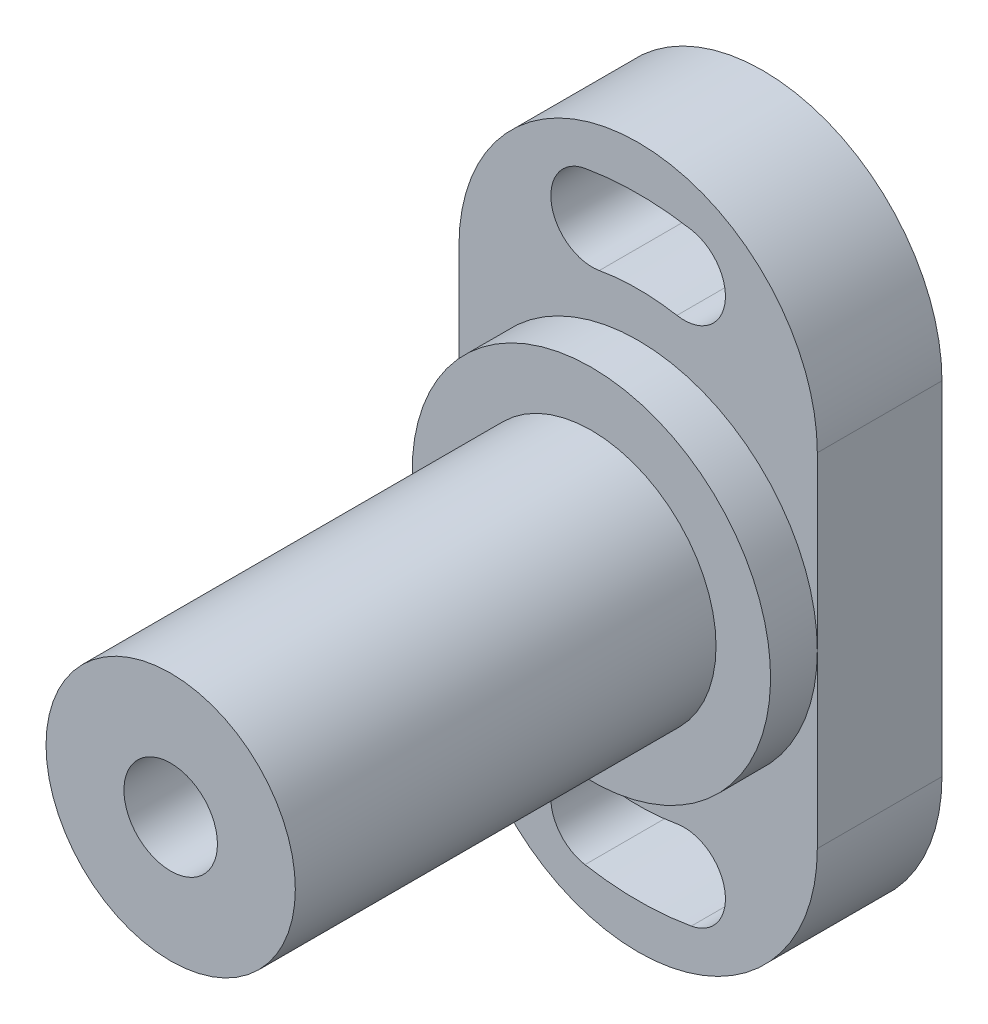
ISO-10303-21;
HEADER;
FILE_DESCRIPTION(('STEP AP214'),'2;1');
FILE_NAME('part.step','',(''),(''),'','','');
FILE_SCHEMA(('AUTOMOTIVE_DESIGN { 1 0 10303 214 1 1 1 1 }'));
ENDSEC;
DATA;
#1=APPLICATION_CONTEXT('core data for automotive mechanical design processes');
#2=APPLICATION_PROTOCOL_DEFINITION('international standard','automotive_design',2000,#1);
#3=PRODUCT_CONTEXT('',#1,'mechanical');
#4=PRODUCT('Part','Part','',(#3));
#5=PRODUCT_RELATED_PRODUCT_CATEGORY('part','',(#4));
#6=PRODUCT_DEFINITION_FORMATION('','',#4);
#7=PRODUCT_DEFINITION_CONTEXT('part definition',#1,'design');
#8=PRODUCT_DEFINITION('design','',#6,#7);
#9=PRODUCT_DEFINITION_SHAPE('','',#8);
#10=(LENGTH_UNIT() NAMED_UNIT(*) SI_UNIT(.MILLI.,.METRE.));
#11=(NAMED_UNIT(*) PLANE_ANGLE_UNIT() SI_UNIT($,.RADIAN.));
#12=(NAMED_UNIT(*) SI_UNIT($,.STERADIAN.) SOLID_ANGLE_UNIT());
#13=UNCERTAINTY_MEASURE_WITH_UNIT(LENGTH_MEASURE(1.E-05),#10,'distance_accuracy_value','');
#14=(GEOMETRIC_REPRESENTATION_CONTEXT(3) GLOBAL_UNCERTAINTY_ASSIGNED_CONTEXT((#13)) GLOBAL_UNIT_ASSIGNED_CONTEXT((#10,
#11,#12)) REPRESENTATION_CONTEXT('',''));
#15=CARTESIAN_POINT('',(0.,0.,0.));
#16=DIRECTION('',(0.,0.,1.));
#17=DIRECTION('',(1.,0.,0.));
#18=AXIS2_PLACEMENT_3D('',#15,#16,#17);
#19=CARTESIAN_POINT('',(8.,0.,38.));
#20=DIRECTION('',(0.,0.,1.));
#21=DIRECTION('',(0.,-1.,0.));
#22=AXIS2_PLACEMENT_3D('',#19,#20,#21);
#23=PLANE('',#22);
#24=CARTESIAN_POINT('',(0.,0.,38.));
#25=DIRECTION('',(0.,0.,-1.));
#26=DIRECTION('',(0.,1.,0.));
#27=AXIS2_PLACEMENT_3D('',#24,#25,#26);
#28=CIRCLE('',#27,8.);
#29=CARTESIAN_POINT('',(0.,8.,38.));
#30=VERTEX_POINT('',#29);
#31=EDGE_CURVE('E138',#30,#30,#28,.T.);
#32=ORIENTED_EDGE('',*,*,#31,.F.);
#33=EDGE_LOOP('',(#32));
#34=FACE_BOUND('',#33,.T.);
#35=CARTESIAN_POINT('',(0.,0.,38.));
#36=DIRECTION('',(0.,0.,1.));
#37=DIRECTION('',(0.,-1.,0.));
#38=AXIS2_PLACEMENT_3D('',#35,#36,#37);
#39=CIRCLE('',#38,3.);
#40=CARTESIAN_POINT('',(0.,-3.,38.));
#41=VERTEX_POINT('',#40);
#42=EDGE_CURVE('E18',#41,#41,#39,.F.);
#43=ORIENTED_EDGE('',*,*,#42,.T.);
#44=EDGE_LOOP('',(#43));
#45=FACE_BOUND('',#44,.T.);
#46=ADVANCED_FACE('F14',(#34,#45),#23,.T.);
#47=CARTESIAN_POINT('',(0.,11.,8.));
#48=DIRECTION('',(0.,0.,1.));
#49=DIRECTION('',(0.,-1.,0.));
#50=AXIS2_PLACEMENT_3D('',#47,#48,#49);
#51=PLANE('',#50);
#52=CARTESIAN_POINT('',(0.,0.,8.));
#53=DIRECTION('',(0.,0.,-1.));
#54=DIRECTION('',(0.,1.,0.));
#55=AXIS2_PLACEMENT_3D('',#52,#53,#54);
#56=CIRCLE('',#55,11.5);
#57=CARTESIAN_POINT('',(-11.5,0.,8.));
#58=VERTEX_POINT('',#57);
#59=CARTESIAN_POINT('',(11.5,0.,8.));
#60=VERTEX_POINT('',#59);
#61=EDGE_CURVE('E129',#58,#60,#56,.T.);
#62=ORIENTED_EDGE('',*,*,#61,.T.);
#63=DIRECTION('',(0.,1.,0.));
#64=VECTOR('',#63,1.);
#65=CARTESIAN_POINT('',(11.5,11.,8.));
#66=LINE('',#65,#64);
#67=CARTESIAN_POINT('',(11.5,11.,8.));
#68=VERTEX_POINT('',#67);
#69=EDGE_CURVE('E118',#60,#68,#66,.T.);
#70=ORIENTED_EDGE('',*,*,#69,.T.);
#71=CARTESIAN_POINT('',(0.,11.,8.));
#72=DIRECTION('',(0.,0.,1.));
#73=DIRECTION('',(0.,-1.,0.));
#74=AXIS2_PLACEMENT_3D('',#71,#72,#73);
#75=CIRCLE('',#74,11.5);
#76=CARTESIAN_POINT('',(-11.5,11.,8.));
#77=VERTEX_POINT('',#76);
#78=EDGE_CURVE('E214',#68,#77,#75,.T.);
#79=ORIENTED_EDGE('',*,*,#78,.T.);
#80=DIRECTION('',(0.,-1.,0.));
#81=VECTOR('',#80,1.);
#82=CARTESIAN_POINT('',(-11.5,11.,8.));
#83=LINE('',#82,#81);
#84=EDGE_CURVE('E132',#77,#58,#83,.T.);
#85=ORIENTED_EDGE('',*,*,#84,.T.);
#86=EDGE_LOOP('',(#62,#70,#79,#85));
#87=FACE_BOUND('',#86,.T.);
#88=CARTESIAN_POINT('',(-2.95201902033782,16.7417318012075,8.));
#89=DIRECTION('',(0.,0.,1.));
#90=DIRECTION('',(0.,1.,0.));
#91=AXIS2_PLACEMENT_3D('',#88,#89,#90);
#92=CIRCLE('',#91,2.65);
#93=CARTESIAN_POINT('',(-3.41218669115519,19.3514723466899,8.));
#94=VERTEX_POINT('',#93);
#95=CARTESIAN_POINT('',(-2.49185134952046,14.1319912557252,8.));
#96=VERTEX_POINT('',#95);
#97=EDGE_CURVE('E188',#94,#96,#92,.T.);
#98=ORIENTED_EDGE('',*,*,#97,.F.);
#99=CARTESIAN_POINT('',(0.,0.,8.));
#100=DIRECTION('',(0.,0.,1.));
#101=DIRECTION('',(0.,-1.,0.));
#102=AXIS2_PLACEMENT_3D('',#99,#100,#101);
#103=CIRCLE('',#102,19.65);
#104=CARTESIAN_POINT('',(3.41218669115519,19.3514723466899,8.));
#105=VERTEX_POINT('',#104);
#106=EDGE_CURVE('E186',#105,#94,#103,.T.);
#107=ORIENTED_EDGE('',*,*,#106,.F.);
#108=CARTESIAN_POINT('',(2.95201902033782,16.7417318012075,8.));
#109=DIRECTION('',(0.,0.,1.));
#110=DIRECTION('',(0.,-1.,0.));
#111=AXIS2_PLACEMENT_3D('',#108,#109,#110);
#112=CIRCLE('',#111,2.65);
#113=CARTESIAN_POINT('',(2.49185134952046,14.1319912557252,8.));
#114=VERTEX_POINT('',#113);
#115=EDGE_CURVE('E193',#114,#105,#112,.T.);
#116=ORIENTED_EDGE('',*,*,#115,.F.);
#117=CARTESIAN_POINT('',(0.,0.,8.));
#118=DIRECTION('',(0.,0.,-1.));
#119=DIRECTION('',(0.,-1.,0.));
#120=AXIS2_PLACEMENT_3D('',#117,#118,#119);
#121=CIRCLE('',#120,14.35);
#122=EDGE_CURVE('E190',#96,#114,#121,.T.);
#123=ORIENTED_EDGE('',*,*,#122,.F.);
#124=EDGE_LOOP('',(#98,#107,#116,#123));
#125=FACE_BOUND('',#124,.T.);
#126=ADVANCED_FACE('F130',(#87,#125),#51,.T.);
#127=EDGE_CURVE('E30',#60,#58,#56,.T.);
#128=ORIENTED_EDGE('',*,*,#127,.T.);
#129=CARTESIAN_POINT('',(-11.5,-11.,8.));
#130=VERTEX_POINT('',#129);
#131=EDGE_CURVE('E216',#58,#130,#83,.T.);
#132=ORIENTED_EDGE('',*,*,#131,.T.);
#133=CARTESIAN_POINT('',(0.,-11.,8.));
#134=DIRECTION('',(0.,0.,1.));
#135=DIRECTION('',(0.,1.,0.));
#136=AXIS2_PLACEMENT_3D('',#133,#134,#135);
#137=CIRCLE('',#136,11.5);
#138=CARTESIAN_POINT('',(11.5,-11.,8.));
#139=VERTEX_POINT('',#138);
#140=EDGE_CURVE('E113',#130,#139,#137,.T.);
#141=ORIENTED_EDGE('',*,*,#140,.T.);
#142=EDGE_CURVE('E108',#139,#60,#66,.T.);
#143=ORIENTED_EDGE('',*,*,#142,.T.);
#144=EDGE_LOOP('',(#128,#132,#141,#143));
#145=FACE_BOUND('',#144,.T.);
#146=CARTESIAN_POINT('',(0.,0.,8.));
#147=DIRECTION('',(0.,0.,-1.));
#148=DIRECTION('',(0.,1.,0.));
#149=AXIS2_PLACEMENT_3D('',#146,#147,#148);
#150=CIRCLE('',#149,14.35);
#151=CARTESIAN_POINT('',(2.49185134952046,-14.1319912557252,8.));
#152=VERTEX_POINT('',#151);
#153=CARTESIAN_POINT('',(-2.49185134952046,-14.1319912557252,8.));
#154=VERTEX_POINT('',#153);
#155=EDGE_CURVE('E159',#152,#154,#150,.T.);
#156=ORIENTED_EDGE('',*,*,#155,.F.);
#157=CARTESIAN_POINT('',(2.95201902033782,-16.7417318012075,8.));
#158=DIRECTION('',(0.,0.,1.));
#159=DIRECTION('',(0.,1.,0.));
#160=AXIS2_PLACEMENT_3D('',#157,#158,#159);
#161=CIRCLE('',#160,2.65);
#162=CARTESIAN_POINT('',(3.41218669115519,-19.3514723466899,8.));
#163=VERTEX_POINT('',#162);
#164=EDGE_CURVE('E157',#163,#152,#161,.T.);
#165=ORIENTED_EDGE('',*,*,#164,.F.);
#166=CARTESIAN_POINT('',(0.,0.,8.));
#167=DIRECTION('',(0.,0.,1.));
#168=DIRECTION('',(0.,1.,0.));
#169=AXIS2_PLACEMENT_3D('',#166,#167,#168);
#170=CIRCLE('',#169,19.65);
#171=CARTESIAN_POINT('',(-3.41218669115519,-19.3514723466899,8.));
#172=VERTEX_POINT('',#171);
#173=EDGE_CURVE('E163',#172,#163,#170,.T.);
#174=ORIENTED_EDGE('',*,*,#173,.F.);
#175=CARTESIAN_POINT('',(-2.95201902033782,-16.7417318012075,8.));
#176=DIRECTION('',(0.,0.,1.));
#177=DIRECTION('',(0.,-1.,0.));
#178=AXIS2_PLACEMENT_3D('',#175,#176,#177);
#179=CIRCLE('',#178,2.65);
#180=EDGE_CURVE('E161',#154,#172,#179,.T.);
#181=ORIENTED_EDGE('',*,*,#180,.F.);
#182=EDGE_LOOP('',(#156,#165,#174,#181));
#183=FACE_BOUND('',#182,.T.);
#184=ADVANCED_FACE('F110',(#145,#183),#51,.T.);
#185=CARTESIAN_POINT('',(0.,11.,0.));
#186=DIRECTION('',(0.,0.,1.));
#187=DIRECTION('',(0.,-1.,0.));
#188=AXIS2_PLACEMENT_3D('',#185,#186,#187);
#189=PLANE('',#188);
#190=CARTESIAN_POINT('',(0.,0.,0.));
#191=DIRECTION('',(0.,0.,1.));
#192=DIRECTION('',(0.,-1.,0.));
#193=AXIS2_PLACEMENT_3D('',#190,#191,#192);
#194=CIRCLE('',#193,19.65);
#195=CARTESIAN_POINT('',(3.41218669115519,19.3514723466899,0.));
#196=VERTEX_POINT('',#195);
#197=CARTESIAN_POINT('',(-3.41218669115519,19.3514723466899,0.));
#198=VERTEX_POINT('',#197);
#199=EDGE_CURVE('E174',#196,#198,#194,.T.);
#200=ORIENTED_EDGE('',*,*,#199,.T.);
#201=CARTESIAN_POINT('',(-2.95201902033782,16.7417318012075,0.));
#202=DIRECTION('',(0.,0.,1.));
#203=DIRECTION('',(0.,1.,0.));
#204=AXIS2_PLACEMENT_3D('',#201,#202,#203);
#205=CIRCLE('',#204,2.65);
#206=CARTESIAN_POINT('',(-2.49185134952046,14.1319912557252,0.));
#207=VERTEX_POINT('',#206);
#208=EDGE_CURVE('E177',#198,#207,#205,.T.);
#209=ORIENTED_EDGE('',*,*,#208,.T.);
#210=CARTESIAN_POINT('',(0.,0.,0.));
#211=DIRECTION('',(0.,0.,-1.));
#212=DIRECTION('',(0.,-1.,0.));
#213=AXIS2_PLACEMENT_3D('',#210,#211,#212);
#214=CIRCLE('',#213,14.35);
#215=CARTESIAN_POINT('',(2.49185134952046,14.1319912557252,0.));
#216=VERTEX_POINT('',#215);
#217=EDGE_CURVE('E180',#207,#216,#214,.T.);
#218=ORIENTED_EDGE('',*,*,#217,.T.);
#219=CARTESIAN_POINT('',(2.95201902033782,16.7417318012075,0.));
#220=DIRECTION('',(0.,0.,1.));
#221=DIRECTION('',(0.,-1.,0.));
#222=AXIS2_PLACEMENT_3D('',#219,#220,#221);
#223=CIRCLE('',#222,2.65);
#224=EDGE_CURVE('E183',#216,#196,#223,.T.);
#225=ORIENTED_EDGE('',*,*,#224,.T.);
#226=EDGE_LOOP('',(#200,#209,#218,#225));
#227=FACE_BOUND('',#226,.T.);
#228=CARTESIAN_POINT('',(0.,11.,0.));
#229=DIRECTION('',(0.,0.,1.));
#230=DIRECTION('',(0.,-1.,0.));
#231=AXIS2_PLACEMENT_3D('',#228,#229,#230);
#232=CIRCLE('',#231,11.5);
#233=CARTESIAN_POINT('',(11.5,11.,0.));
#234=VERTEX_POINT('',#233);
#235=CARTESIAN_POINT('',(-11.5,11.,0.));
#236=VERTEX_POINT('',#235);
#237=EDGE_CURVE('E205',#234,#236,#232,.T.);
#238=ORIENTED_EDGE('',*,*,#237,.F.);
#239=DIRECTION('',(0.,1.,0.));
#240=VECTOR('',#239,1.);
#241=CARTESIAN_POINT('',(11.5,11.,0.));
#242=LINE('',#241,#240);
#243=CARTESIAN_POINT('',(11.5,-11.,0.));
#244=VERTEX_POINT('',#243);
#245=EDGE_CURVE('E212',#244,#234,#242,.T.);
#246=ORIENTED_EDGE('',*,*,#245,.F.);
#247=CARTESIAN_POINT('',(0.,-11.,0.));
#248=DIRECTION('',(0.,0.,1.));
#249=DIRECTION('',(0.,1.,0.));
#250=AXIS2_PLACEMENT_3D('',#247,#248,#249);
#251=CIRCLE('',#250,11.5);
#252=CARTESIAN_POINT('',(-11.5,-11.,0.));
#253=VERTEX_POINT('',#252);
#254=EDGE_CURVE('E210',#253,#244,#251,.T.);
#255=ORIENTED_EDGE('',*,*,#254,.F.);
#256=DIRECTION('',(0.,-1.,0.));
#257=VECTOR('',#256,1.);
#258=CARTESIAN_POINT('',(-11.5,11.,0.));
#259=LINE('',#258,#257);
#260=EDGE_CURVE('E208',#236,#253,#259,.T.);
#261=ORIENTED_EDGE('',*,*,#260,.F.);
#262=EDGE_LOOP('',(#238,#246,#255,#261));
#263=FACE_BOUND('',#262,.T.);
#264=CARTESIAN_POINT('',(2.95201902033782,-16.7417318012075,0.));
#265=DIRECTION('',(0.,0.,1.));
#266=DIRECTION('',(0.,1.,0.));
#267=AXIS2_PLACEMENT_3D('',#264,#265,#266);
#268=CIRCLE('',#267,2.65);
#269=CARTESIAN_POINT('',(3.41218669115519,-19.3514723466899,0.));
#270=VERTEX_POINT('',#269);
#271=CARTESIAN_POINT('',(2.49185134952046,-14.1319912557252,0.));
#272=VERTEX_POINT('',#271);
#273=EDGE_CURVE('E145',#270,#272,#268,.T.);
#274=ORIENTED_EDGE('',*,*,#273,.T.);
#275=CARTESIAN_POINT('',(0.,0.,0.));
#276=DIRECTION('',(0.,0.,-1.));
#277=DIRECTION('',(0.,1.,0.));
#278=AXIS2_PLACEMENT_3D('',#275,#276,#277);
#279=CIRCLE('',#278,14.35);
#280=CARTESIAN_POINT('',(-2.49185134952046,-14.1319912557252,0.));
#281=VERTEX_POINT('',#280);
#282=EDGE_CURVE('E148',#272,#281,#279,.T.);
#283=ORIENTED_EDGE('',*,*,#282,.T.);
#284=CARTESIAN_POINT('',(-2.95201902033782,-16.7417318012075,0.));
#285=DIRECTION('',(0.,0.,1.));
#286=DIRECTION('',(0.,-1.,0.));
#287=AXIS2_PLACEMENT_3D('',#284,#285,#286);
#288=CIRCLE('',#287,2.65);
#289=CARTESIAN_POINT('',(-3.41218669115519,-19.3514723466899,0.));
#290=VERTEX_POINT('',#289);
#291=EDGE_CURVE('E151',#281,#290,#288,.T.);
#292=ORIENTED_EDGE('',*,*,#291,.T.);
#293=CARTESIAN_POINT('',(0.,0.,0.));
#294=DIRECTION('',(0.,0.,1.));
#295=DIRECTION('',(0.,1.,0.));
#296=AXIS2_PLACEMENT_3D('',#293,#294,#295);
#297=CIRCLE('',#296,19.65);
#298=EDGE_CURVE('E154',#290,#270,#297,.T.);
#299=ORIENTED_EDGE('',*,*,#298,.T.);
#300=EDGE_LOOP('',(#274,#283,#292,#299));
#301=FACE_BOUND('',#300,.T.);
#302=ADVANCED_FACE('F234',(#227,#263,#301),#189,.F.);
#303=CARTESIAN_POINT('',(0.,11.,8.));
#304=DIRECTION('',(0.,0.,-1.));
#305=DIRECTION('',(0.,1.,0.));
#306=AXIS2_PLACEMENT_3D('',#303,#304,#305);
#307=CYLINDRICAL_SURFACE('',#306,11.5);
#308=ORIENTED_EDGE('',*,*,#237,.T.);
#309=DIRECTION('',(0.,0.,-1.));
#310=VECTOR('',#309,1.);
#311=CARTESIAN_POINT('',(-11.5,11.,8.));
#312=LINE('',#311,#310);
#313=EDGE_CURVE('E23',#77,#236,#312,.T.);
#314=ORIENTED_EDGE('',*,*,#313,.F.);
#315=ORIENTED_EDGE('',*,*,#78,.F.);
#316=DIRECTION('',(0.,0.,-1.));
#317=VECTOR('',#316,1.);
#318=CARTESIAN_POINT('',(11.5,11.,8.));
#319=LINE('',#318,#317);
#320=EDGE_CURVE('E117',#68,#234,#319,.T.);
#321=ORIENTED_EDGE('',*,*,#320,.T.);
#322=EDGE_LOOP('',(#308,#314,#315,#321));
#323=FACE_BOUND('',#322,.T.);
#324=ADVANCED_FACE('F16',(#323),#307,.T.);
#325=CARTESIAN_POINT('',(-11.5,11.,8.));
#326=DIRECTION('',(1.,0.,0.));
#327=DIRECTION('',(0.,1.,0.));
#328=AXIS2_PLACEMENT_3D('',#325,#326,#327);
#329=PLANE('',#328);
#330=ORIENTED_EDGE('',*,*,#260,.T.);
#331=DIRECTION('',(0.,0.,-1.));
#332=VECTOR('',#331,1.);
#333=CARTESIAN_POINT('',(-11.5,-11.,8.));
#334=LINE('',#333,#332);
#335=EDGE_CURVE('E222',#130,#253,#334,.T.);
#336=ORIENTED_EDGE('',*,*,#335,.F.);
#337=ORIENTED_EDGE('',*,*,#131,.F.);
#338=ORIENTED_EDGE('',*,*,#84,.F.);
#339=ORIENTED_EDGE('',*,*,#313,.T.);
#340=EDGE_LOOP('',(#330,#336,#337,#338,#339));
#341=FACE_BOUND('',#340,.T.);
#342=ADVANCED_FACE('F228',(#341),#329,.F.);
#343=CARTESIAN_POINT('',(0.,-11.,8.));
#344=DIRECTION('',(0.,0.,-1.));
#345=DIRECTION('',(0.,1.,0.));
#346=AXIS2_PLACEMENT_3D('',#343,#344,#345);
#347=CYLINDRICAL_SURFACE('',#346,11.5);
#348=ORIENTED_EDGE('',*,*,#254,.T.);
#349=DIRECTION('',(0.,0.,-1.));
#350=VECTOR('',#349,1.);
#351=CARTESIAN_POINT('',(11.5,-11.,8.));
#352=LINE('',#351,#350);
#353=EDGE_CURVE('E220',#139,#244,#352,.T.);
#354=ORIENTED_EDGE('',*,*,#353,.F.);
#355=ORIENTED_EDGE('',*,*,#140,.F.);
#356=ORIENTED_EDGE('',*,*,#335,.T.);
#357=EDGE_LOOP('',(#348,#354,#355,#356));
#358=FACE_BOUND('',#357,.T.);
#359=ADVANCED_FACE('F238',(#358),#347,.T.);
#360=CARTESIAN_POINT('',(11.5,11.,8.));
#361=DIRECTION('',(-1.,0.,0.));
#362=DIRECTION('',(0.,-1.,0.));
#363=AXIS2_PLACEMENT_3D('',#360,#361,#362);
#364=PLANE('',#363);
#365=ORIENTED_EDGE('',*,*,#245,.T.);
#366=ORIENTED_EDGE('',*,*,#320,.F.);
#367=ORIENTED_EDGE('',*,*,#69,.F.);
#368=ORIENTED_EDGE('',*,*,#142,.F.);
#369=ORIENTED_EDGE('',*,*,#353,.T.);
#370=EDGE_LOOP('',(#365,#366,#367,#368,#369));
#371=FACE_BOUND('',#370,.T.);
#372=ADVANCED_FACE('F122',(#371),#364,.F.);
#373=CARTESIAN_POINT('',(0.,0.,8.));
#374=DIRECTION('',(0.,0.,-1.));
#375=DIRECTION('',(0.,1.,0.));
#376=AXIS2_PLACEMENT_3D('',#373,#374,#375);
#377=CYLINDRICAL_SURFACE('',#376,19.65);
#378=ORIENTED_EDGE('',*,*,#199,.F.);
#379=DIRECTION('',(0.,0.,-1.));
#380=VECTOR('',#379,1.);
#381=CARTESIAN_POINT('',(3.41218669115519,19.3514723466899,8.));
#382=LINE('',#381,#380);
#383=EDGE_CURVE('E195',#105,#196,#382,.T.);
#384=ORIENTED_EDGE('',*,*,#383,.F.);
#385=ORIENTED_EDGE('',*,*,#106,.T.);
#386=DIRECTION('',(0.,0.,-1.));
#387=VECTOR('',#386,1.);
#388=CARTESIAN_POINT('',(-3.41218669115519,19.3514723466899,8.));
#389=LINE('',#388,#387);
#390=EDGE_CURVE('E202',#94,#198,#389,.T.);
#391=ORIENTED_EDGE('',*,*,#390,.T.);
#392=EDGE_LOOP('',(#378,#384,#385,#391));
#393=FACE_BOUND('',#392,.T.);
#394=ADVANCED_FACE('F247',(#393),#377,.F.);
#395=CARTESIAN_POINT('',(-2.95201902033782,16.7417318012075,8.));
#396=DIRECTION('',(0.,0.,-1.));
#397=DIRECTION('',(0.,1.,0.));
#398=AXIS2_PLACEMENT_3D('',#395,#396,#397);
#399=CYLINDRICAL_SURFACE('',#398,2.65);
#400=ORIENTED_EDGE('',*,*,#208,.F.);
#401=ORIENTED_EDGE('',*,*,#390,.F.);
#402=ORIENTED_EDGE('',*,*,#97,.T.);
#403=DIRECTION('',(0.,0.,-1.));
#404=VECTOR('',#403,1.);
#405=CARTESIAN_POINT('',(-2.49185134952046,14.1319912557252,8.));
#406=LINE('',#405,#404);
#407=EDGE_CURVE('E200',#96,#207,#406,.T.);
#408=ORIENTED_EDGE('',*,*,#407,.T.);
#409=EDGE_LOOP('',(#400,#401,#402,#408));
#410=FACE_BOUND('',#409,.T.);
#411=ADVANCED_FACE('F286',(#410),#399,.F.);
#412=CARTESIAN_POINT('',(0.,0.,8.));
#413=DIRECTION('',(0.,0.,-1.));
#414=DIRECTION('',(0.,1.,0.));
#415=AXIS2_PLACEMENT_3D('',#412,#413,#414);
#416=CYLINDRICAL_SURFACE('',#415,14.35);
#417=ORIENTED_EDGE('',*,*,#217,.F.);
#418=ORIENTED_EDGE('',*,*,#407,.F.);
#419=ORIENTED_EDGE('',*,*,#122,.T.);
#420=DIRECTION('',(0.,0.,-1.));
#421=VECTOR('',#420,1.);
#422=CARTESIAN_POINT('',(2.49185134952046,14.1319912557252,8.));
#423=LINE('',#422,#421);
#424=EDGE_CURVE('E198',#114,#216,#423,.T.);
#425=ORIENTED_EDGE('',*,*,#424,.T.);
#426=EDGE_LOOP('',(#417,#418,#419,#425));
#427=FACE_BOUND('',#426,.T.);
#428=ADVANCED_FACE('F282',(#427),#416,.T.);
#429=CARTESIAN_POINT('',(2.95201902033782,16.7417318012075,8.));
#430=DIRECTION('',(0.,0.,-1.));
#431=DIRECTION('',(0.,1.,0.));
#432=AXIS2_PLACEMENT_3D('',#429,#430,#431);
#433=CYLINDRICAL_SURFACE('',#432,2.65);
#434=ORIENTED_EDGE('',*,*,#224,.F.);
#435=ORIENTED_EDGE('',*,*,#424,.F.);
#436=ORIENTED_EDGE('',*,*,#115,.T.);
#437=ORIENTED_EDGE('',*,*,#383,.T.);
#438=EDGE_LOOP('',(#434,#435,#436,#437));
#439=FACE_BOUND('',#438,.T.);
#440=ADVANCED_FACE('F278',(#439),#433,.F.);
#441=CARTESIAN_POINT('',(2.95201902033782,-16.7417318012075,8.));
#442=DIRECTION('',(0.,0.,-1.));
#443=DIRECTION('',(0.,1.,0.));
#444=AXIS2_PLACEMENT_3D('',#441,#442,#443);
#445=CYLINDRICAL_SURFACE('',#444,2.65);
#446=ORIENTED_EDGE('',*,*,#273,.F.);
#447=DIRECTION('',(0.,0.,-1.));
#448=VECTOR('',#447,1.);
#449=CARTESIAN_POINT('',(3.41218669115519,-19.3514723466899,8.));
#450=LINE('',#449,#448);
#451=EDGE_CURVE('E165',#163,#270,#450,.T.);
#452=ORIENTED_EDGE('',*,*,#451,.F.);
#453=ORIENTED_EDGE('',*,*,#164,.T.);
#454=DIRECTION('',(0.,0.,-1.));
#455=VECTOR('',#454,1.);
#456=CARTESIAN_POINT('',(2.49185134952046,-14.1319912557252,8.));
#457=LINE('',#456,#455);
#458=EDGE_CURVE('E171',#152,#272,#457,.T.);
#459=ORIENTED_EDGE('',*,*,#458,.T.);
#460=EDGE_LOOP('',(#446,#452,#453,#459));
#461=FACE_BOUND('',#460,.T.);
#462=ADVANCED_FACE('F274',(#461),#445,.F.);
#463=CARTESIAN_POINT('',(0.,0.,8.));
#464=DIRECTION('',(0.,0.,-1.));
#465=DIRECTION('',(0.,1.,0.));
#466=AXIS2_PLACEMENT_3D('',#463,#464,#465);
#467=CYLINDRICAL_SURFACE('',#466,14.35);
#468=ORIENTED_EDGE('',*,*,#282,.F.);
#469=ORIENTED_EDGE('',*,*,#458,.F.);
#470=ORIENTED_EDGE('',*,*,#155,.T.);
#471=DIRECTION('',(0.,0.,-1.));
#472=VECTOR('',#471,1.);
#473=CARTESIAN_POINT('',(-2.49185134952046,-14.1319912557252,8.));
#474=LINE('',#473,#472);
#475=EDGE_CURVE('E169',#154,#281,#474,.T.);
#476=ORIENTED_EDGE('',*,*,#475,.T.);
#477=EDGE_LOOP('',(#468,#469,#470,#476));
#478=FACE_BOUND('',#477,.T.);
#479=ADVANCED_FACE('F270',(#478),#467,.T.);
#480=CARTESIAN_POINT('',(-2.95201902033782,-16.7417318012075,8.));
#481=DIRECTION('',(0.,0.,-1.));
#482=DIRECTION('',(0.,1.,0.));
#483=AXIS2_PLACEMENT_3D('',#480,#481,#482);
#484=CYLINDRICAL_SURFACE('',#483,2.65);
#485=ORIENTED_EDGE('',*,*,#291,.F.);
#486=ORIENTED_EDGE('',*,*,#475,.F.);
#487=ORIENTED_EDGE('',*,*,#180,.T.);
#488=DIRECTION('',(0.,0.,-1.));
#489=VECTOR('',#488,1.);
#490=CARTESIAN_POINT('',(-3.41218669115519,-19.3514723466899,8.));
#491=LINE('',#490,#489);
#492=EDGE_CURVE('E38',#172,#290,#491,.T.);
#493=ORIENTED_EDGE('',*,*,#492,.T.);
#494=EDGE_LOOP('',(#485,#486,#487,#493));
#495=FACE_BOUND('',#494,.T.);
#496=ADVANCED_FACE('F267',(#495),#484,.F.);
#497=CARTESIAN_POINT('',(0.,0.,8.));
#498=DIRECTION('',(0.,0.,-1.));
#499=DIRECTION('',(0.,1.,0.));
#500=AXIS2_PLACEMENT_3D('',#497,#498,#499);
#501=CYLINDRICAL_SURFACE('',#500,19.65);
#502=ORIENTED_EDGE('',*,*,#298,.F.);
#503=ORIENTED_EDGE('',*,*,#492,.F.);
#504=ORIENTED_EDGE('',*,*,#173,.T.);
#505=ORIENTED_EDGE('',*,*,#451,.T.);
#506=EDGE_LOOP('',(#502,#503,#504,#505));
#507=FACE_BOUND('',#506,.T.);
#508=ADVANCED_FACE('F263',(#507),#501,.F.);
#509=CARTESIAN_POINT('',(8.,0.,11.));
#510=DIRECTION('',(0.,0.,1.));
#511=DIRECTION('',(0.,-1.,0.));
#512=AXIS2_PLACEMENT_3D('',#509,#510,#511);
#513=PLANE('',#512);
#514=CARTESIAN_POINT('',(0.,0.,11.));
#515=DIRECTION('',(0.,0.,1.));
#516=DIRECTION('',(0.,-1.,0.));
#517=AXIS2_PLACEMENT_3D('',#514,#515,#516);
#518=CIRCLE('',#517,8.);
#519=CARTESIAN_POINT('',(0.,-8.,11.));
#520=VERTEX_POINT('',#519);
#521=EDGE_CURVE('E9',#520,#520,#518,.F.);
#522=ORIENTED_EDGE('',*,*,#521,.T.);
#523=EDGE_LOOP('',(#522));
#524=FACE_BOUND('',#523,.T.);
#525=CARTESIAN_POINT('',(0.,0.,11.));
#526=DIRECTION('',(0.,0.,-1.));
#527=DIRECTION('',(0.,1.,0.));
#528=AXIS2_PLACEMENT_3D('',#525,#526,#527);
#529=CIRCLE('',#528,11.5);
#530=CARTESIAN_POINT('',(0.,11.5,11.));
#531=VERTEX_POINT('',#530);
#532=EDGE_CURVE('E136',#531,#531,#529,.T.);
#533=ORIENTED_EDGE('',*,*,#532,.F.);
#534=EDGE_LOOP('',(#533));
#535=FACE_BOUND('',#534,.T.);
#536=ADVANCED_FACE('F266',(#524,#535),#513,.T.);
#537=CARTESIAN_POINT('',(0.,0.,0.));
#538=DIRECTION('',(0.,0.,-1.));
#539=DIRECTION('',(0.,1.,0.));
#540=AXIS2_PLACEMENT_3D('',#537,#538,#539);
#541=CYLINDRICAL_SURFACE('',#540,11.5);
#542=ORIENTED_EDGE('',*,*,#532,.T.);
#543=EDGE_LOOP('',(#542));
#544=FACE_BOUND('',#543,.T.);
#545=ORIENTED_EDGE('',*,*,#127,.F.);
#546=ORIENTED_EDGE('',*,*,#61,.F.);
#547=EDGE_LOOP('',(#545,#546));
#548=FACE_BOUND('',#547,.T.);
#549=ADVANCED_FACE('F135',(#544,#548),#541,.T.);
#550=CARTESIAN_POINT('',(0.,0.,0.));
#551=DIRECTION('',(0.,0.,-1.));
#552=DIRECTION('',(0.,1.,0.));
#553=AXIS2_PLACEMENT_3D('',#550,#551,#552);
#554=CYLINDRICAL_SURFACE('',#553,8.);
#555=ORIENTED_EDGE('',*,*,#521,.F.);
#556=EDGE_LOOP('',(#555));
#557=FACE_BOUND('',#556,.T.);
#558=ORIENTED_EDGE('',*,*,#31,.T.);
#559=EDGE_LOOP('',(#558));
#560=FACE_BOUND('',#559,.T.);
#561=ADVANCED_FACE('F261',(#557,#560),#554,.T.);
#562=CARTESIAN_POINT('',(0.,0.,8.53));
#563=DIRECTION('',(0.,0.,1.));
#564=DIRECTION('',(0.342020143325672,0.939692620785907,0.));
#565=AXIS2_PLACEMENT_3D('',#562,#563,#564);
#566=PLANE('',#565);
#567=CARTESIAN_POINT('',(0.,0.,8.53));
#568=DIRECTION('',(0.,0.,1.));
#569=DIRECTION('',(0.342020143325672,0.939692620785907,0.));
#570=AXIS2_PLACEMENT_3D('',#567,#568,#569);
#571=CIRCLE('',#570,3.);
#572=CARTESIAN_POINT('',(1.02606042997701,2.81907786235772,8.53));
#573=VERTEX_POINT('',#572);
#574=EDGE_CURVE('E141',#573,#573,#571,.T.);
#575=ORIENTED_EDGE('',*,*,#574,.T.);
#576=EDGE_LOOP('',(#575));
#577=FACE_BOUND('',#576,.T.);
#578=ADVANCED_FACE('F412',(#577),#566,.T.);
#579=CARTESIAN_POINT('',(0.,0.,60.2365938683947));
#580=DIRECTION('',(0.,0.,1.));
#581=DIRECTION('',(0.342020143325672,0.939692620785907,0.));
#582=AXIS2_PLACEMENT_3D('',#579,#580,#581);
#583=CYLINDRICAL_SURFACE('',#582,3.);
#584=ORIENTED_EDGE('',*,*,#42,.F.);
#585=EDGE_LOOP('',(#584));
#586=FACE_BOUND('',#585,.T.);
#587=ORIENTED_EDGE('',*,*,#574,.F.);
#588=EDGE_LOOP('',(#587));
#589=FACE_BOUND('',#588,.T.);
#590=ADVANCED_FACE('F420',(#586,#589),#583,.F.);
#591=CLOSED_SHELL('',(#46,#126,#184,#302,#324,#342,#359,#372,#394,#411,#428,#440,#462,#479,#496,
#508,#536,#549,#561,#578,#590));
#592=MANIFOLD_SOLID_BREP('B1',#591);
#593=ADVANCED_BREP_SHAPE_REPRESENTATION('',(#18,#592),#14);
#594=SHAPE_DEFINITION_REPRESENTATION(#9,#593);
ENDSEC;
END-ISO-10303-21;
